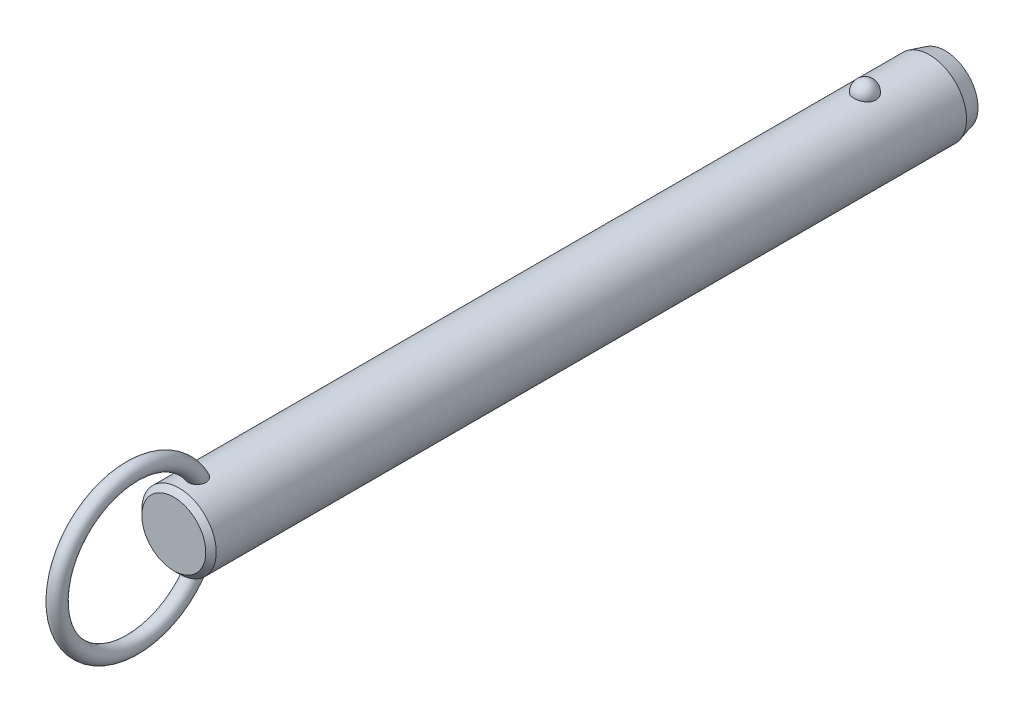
ISO-10303-21;
HEADER;
FILE_DESCRIPTION(('STEP AP214'),'2;1');
FILE_NAME('part.step','',(''),(''),'','','');
FILE_SCHEMA(('AUTOMOTIVE_DESIGN { 1 0 10303 214 1 1 1 1 }'));
ENDSEC;
DATA;
#1=APPLICATION_CONTEXT('core data for automotive mechanical design processes');
#2=APPLICATION_PROTOCOL_DEFINITION('international standard','automotive_design',2000,#1);
#3=PRODUCT_CONTEXT('',#1,'mechanical');
#4=PRODUCT('Part','Part','',(#3));
#5=PRODUCT_RELATED_PRODUCT_CATEGORY('part','',(#4));
#6=PRODUCT_DEFINITION_FORMATION('','',#4);
#7=PRODUCT_DEFINITION_CONTEXT('part definition',#1,'design');
#8=PRODUCT_DEFINITION('design','',#6,#7);
#9=PRODUCT_DEFINITION_SHAPE('','',#8);
#10=(LENGTH_UNIT() NAMED_UNIT(*) SI_UNIT(.MILLI.,.METRE.));
#11=(NAMED_UNIT(*) PLANE_ANGLE_UNIT() SI_UNIT($,.RADIAN.));
#12=(NAMED_UNIT(*) SI_UNIT($,.STERADIAN.) SOLID_ANGLE_UNIT());
#13=UNCERTAINTY_MEASURE_WITH_UNIT(LENGTH_MEASURE(1.E-05),#10,'distance_accuracy_value','');
#14=(GEOMETRIC_REPRESENTATION_CONTEXT(3) GLOBAL_UNCERTAINTY_ASSIGNED_CONTEXT((#13)) GLOBAL_UNIT_ASSIGNED_CONTEXT((#10,
#11,#12)) REPRESENTATION_CONTEXT('',''));
#15=CARTESIAN_POINT('',(0.,0.,0.));
#16=DIRECTION('',(0.,0.,1.));
#17=DIRECTION('',(1.,0.,0.));
#18=AXIS2_PLACEMENT_3D('',#15,#16,#17);
#19=CARTESIAN_POINT('',(0.,0.,121.9));
#20=DIRECTION('',(0.,0.,-1.));
#21=DIRECTION('',(-1.,0.,0.));
#22=AXIS2_PLACEMENT_3D('',#19,#20,#21);
#23=CYLINDRICAL_SURFACE('',#22,7.1);
#24=CARTESIAN_POINT('',(2.0769088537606,6.78943661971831,-2.1));
#25=CARTESIAN_POINT('',(2.07690739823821,6.78943796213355,-1.98268154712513));
#26=CARTESIAN_POINT('',(2.06738130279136,6.79237331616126,-1.86534506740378));
#27=CARTESIAN_POINT('',(2.0295040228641,6.8037853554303,-1.63400788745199));
#28=CARTESIAN_POINT('',(2.00114757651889,6.81226358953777,-1.52000812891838));
#29=CARTESIAN_POINT('',(1.92632025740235,6.83379798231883,-1.29863433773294));
#30=CARTESIAN_POINT('',(1.87985726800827,6.84685214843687,-1.19125744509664));
#31=CARTESIAN_POINT('',(1.76995205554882,6.87608091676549,-0.98604657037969));
#32=CARTESIAN_POINT('',(1.70650980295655,6.8922555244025,-0.88821260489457));
#33=CARTESIAN_POINT('',(1.5638119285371,6.92602930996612,-0.704242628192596));
#34=CARTESIAN_POINT('',(1.4844714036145,6.94363582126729,-0.618173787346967));
#35=CARTESIAN_POINT('',(1.31221746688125,6.97823658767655,-0.460740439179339));
#36=CARTESIAN_POINT('',(1.21930409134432,6.99523084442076,-0.389375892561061));
#37=CARTESIAN_POINT('',(1.02268781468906,7.02666176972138,-0.263547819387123));
#38=CARTESIAN_POINT('',(0.91902009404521,7.04110638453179,-0.209031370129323));
#39=CARTESIAN_POINT('',(0.703548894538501,7.06588726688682,-0.118163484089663));
#40=CARTESIAN_POINT('',(0.591746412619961,7.07622403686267,-0.0818098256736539));
#41=CARTESIAN_POINT('',(0.365557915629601,7.09147068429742,-0.0288711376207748));
#42=CARTESIAN_POINT('',(0.251267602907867,7.09648447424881,-0.0119070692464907));
#43=CARTESIAN_POINT('',(0.0213499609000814,7.10089837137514,0.00304925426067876));
#44=CARTESIAN_POINT('',(-0.0942772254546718,7.10029907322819,0.00104351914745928));
#45=CARTESIAN_POINT('',(-0.321651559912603,7.09360829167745,-0.0216931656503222));
#46=CARTESIAN_POINT('',(-0.433431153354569,7.08760388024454,-0.0421272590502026));
#47=CARTESIAN_POINT('',(-0.651862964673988,7.07086131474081,-0.100729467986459));
#48=CARTESIAN_POINT('',(-0.758515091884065,7.06012307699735,-0.138897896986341));
#49=CARTESIAN_POINT('',(-0.964449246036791,7.03496097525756,-0.232213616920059));
#50=CARTESIAN_POINT('',(-1.06368095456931,7.02051445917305,-0.287465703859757));
#51=CARTESIAN_POINT('',(-1.25145353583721,6.98948740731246,-0.413383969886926));
#52=CARTESIAN_POINT('',(-1.33999321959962,6.97290663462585,-0.48405186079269));
#53=CARTESIAN_POINT('',(-1.50591604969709,6.93898770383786,-0.640594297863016));
#54=CARTESIAN_POINT('',(-1.58302488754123,6.92164094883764,-0.726757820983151));
#55=CARTESIAN_POINT('',(-1.72189320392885,6.8884103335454,-0.91092752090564));
#56=CARTESIAN_POINT('',(-1.78365144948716,6.87252659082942,-1.008934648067));
#57=CARTESIAN_POINT('',(-1.89101272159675,6.84377189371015,-1.21549497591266));
#58=CARTESIAN_POINT('',(-1.93639553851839,6.83094274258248,-1.32416860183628));
#59=CARTESIAN_POINT('',(-2.00874275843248,6.81002070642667,-1.54791500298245));
#60=CARTESIAN_POINT('',(-2.03570774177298,6.80192767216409,-1.66298757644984));
#61=CARTESIAN_POINT('',(-2.07047276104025,6.7914266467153,-1.89571453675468));
#62=CARTESIAN_POINT('',(-2.07835878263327,6.78899315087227,-2.01335491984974));
#63=CARTESIAN_POINT('',(-2.07502083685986,6.79001409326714,-2.24833570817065));
#64=CARTESIAN_POINT('',(-2.06379746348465,6.7934683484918,-2.36567612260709));
#65=CARTESIAN_POINT('',(-2.02263913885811,6.80583442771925,-2.59603194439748));
#66=CARTESIAN_POINT('',(-1.99281127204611,6.81471501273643,-2.70906820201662));
#67=CARTESIAN_POINT('',(-1.91526639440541,6.83691232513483,-2.92836575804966));
#68=CARTESIAN_POINT('',(-1.8675486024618,6.85022924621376,-3.03462676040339));
#69=CARTESIAN_POINT('',(-1.75504492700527,6.87991336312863,-3.23806487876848));
#70=CARTESIAN_POINT('',(-1.69015924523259,6.89629822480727,-3.33518422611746));
#71=CARTESIAN_POINT('',(-1.54505404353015,6.93024852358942,-3.51697105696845));
#72=CARTESIAN_POINT('',(-1.46483385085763,6.94781401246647,-3.60163799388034));
#73=CARTESIAN_POINT('',(-1.29071406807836,6.98225977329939,-3.75654119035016));
#74=CARTESIAN_POINT('',(-1.19675650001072,6.99913673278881,-3.82671308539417));
#75=CARTESIAN_POINT('',(-0.997940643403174,7.03023618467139,-3.9501837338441));
#76=CARTESIAN_POINT('',(-0.89308318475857,7.04445887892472,-4.00348377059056));
#77=CARTESIAN_POINT('',(-0.676902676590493,7.06848365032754,-4.09107242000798));
#78=CARTESIAN_POINT('',(-0.565686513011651,7.0783430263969,-4.12560889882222));
#79=CARTESIAN_POINT('',(-0.338739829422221,7.09282534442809,-4.17575450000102));
#80=CARTESIAN_POINT('',(-0.223009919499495,7.09744899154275,-4.19136617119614));
#81=CARTESIAN_POINT('',(0.00707628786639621,7.10090930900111,-4.20307965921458));
#82=CARTESIAN_POINT('',(0.121410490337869,7.09986531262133,-4.19958377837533));
#83=CARTESIAN_POINT('',(0.347815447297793,7.092380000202,-4.17411564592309));
#84=CARTESIAN_POINT('',(0.459886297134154,7.08593891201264,-4.15214417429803));
#85=CARTESIAN_POINT('',(0.678084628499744,7.06838983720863,-4.09049562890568));
#86=CARTESIAN_POINT('',(0.784237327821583,7.05730369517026,-4.05090137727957));
#87=CARTESIAN_POINT('',(0.988305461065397,7.03163139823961,-3.95511447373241));
#88=CARTESIAN_POINT('',(1.08622031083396,7.01704499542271,-3.89892064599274));
#89=CARTESIAN_POINT('',(1.27284490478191,6.98562668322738,-3.77035541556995));
#90=CARTESIAN_POINT('',(1.36137372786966,6.96876135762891,-3.69772964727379));
#91=CARTESIAN_POINT('',(1.52509486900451,6.93477412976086,-3.53878279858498));
#92=CARTESIAN_POINT('',(1.60028496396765,6.91765218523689,-3.45245943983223));
#93=CARTESIAN_POINT('',(1.73681688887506,6.88465753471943,-3.26658774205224));
#94=CARTESIAN_POINT('',(1.79785966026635,6.86881574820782,-3.16681408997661));
#95=CARTESIAN_POINT('',(1.90265327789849,6.84053157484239,-2.95814408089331));
#96=CARTESIAN_POINT('',(1.94640861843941,6.82808830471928,-2.84925010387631));
#97=CARTESIAN_POINT('',(2.01274378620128,6.80881460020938,-2.63454318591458));
#98=CARTESIAN_POINT('',(2.03676193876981,6.80160856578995,-2.52920574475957));
#99=CARTESIAN_POINT('',(2.06884490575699,6.79191902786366,-2.3159172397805));
#100=CARTESIAN_POINT('',(2.07691019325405,6.78943538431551,-2.20796625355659));
#101=CARTESIAN_POINT('',(2.0769088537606,6.78943661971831,-2.1));
#102=B_SPLINE_CURVE_WITH_KNOTS('',3,(#24,#25,#26,#27,#28,#29,#30,#31,#32,#33,#34,#35,#36,#37,
#38,#39,#40,#41,#42,#43,#44,#45,#46,#47,#48,#49,#50,#51,#52,#53,#54,#55,#56,#57,#58,#59,#60,#61,
#62,#63,#64,#65,#66,#67,#68,#69,#70,#71,#72,#73,#74,#75,#76,#77,#78,#79,#80,#81,#82,#83,#84,#85,
#86,#87,#88,#89,#90,#91,#92,#93,#94,#95,#96,#97,#98,#99,#100,#101),.UNSPECIFIED.,.T.,.F.,(4,2,2,
2,2,2,2,2,2,2,2,2,2,2,2,2,2,2,2,2,2,2,2,2,2,2,2,2,2,2,2,2,2,2,2,2,2,2,4),(0.,0.351568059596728,
0.703234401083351,1.05474780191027,1.40626181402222,1.75970563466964,2.11314851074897,
2.4654696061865,2.81774759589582,3.16301449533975,3.50824481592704,3.84801136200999,
4.18778391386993,4.52968352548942,4.87162112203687,5.22076181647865,5.56993054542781,
5.92363364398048,6.27732559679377,6.62942052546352,6.98150450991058,7.33158042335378,
7.68167162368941,8.03384443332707,8.38603269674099,8.73975272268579,9.09344583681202,
9.44234545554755,9.79119807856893,10.1327344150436,10.4742563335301,10.8141898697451,
11.1541474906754,11.4997793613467,11.8454687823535,12.1979079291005,12.5502553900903,
12.8738073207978,13.1973496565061),.UNSPECIFIED.);
#103=CARTESIAN_POINT('',(2.0769088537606,6.78943661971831,-2.1));
#104=VERTEX_POINT('',#103);
#105=EDGE_CURVE('E41',#104,#104,#102,.T.);
#106=ORIENTED_EDGE('',*,*,#105,.T.);
#107=EDGE_LOOP('',(#106));
#108=FACE_BOUND('',#107,.T.);
#109=CARTESIAN_POINT('',(0.,0.,128.82));
#110=DIRECTION('',(0.,0.,1.));
#111=DIRECTION('',(1.,0.,0.));
#112=AXIS2_PLACEMENT_3D('',#109,#110,#111);
#113=CIRCLE('',#112,7.1);
#114=CARTESIAN_POINT('',(7.1,0.,128.82));
#115=VERTEX_POINT('',#114);
#116=EDGE_CURVE('E10',#115,#115,#113,.F.);
#117=ORIENTED_EDGE('',*,*,#116,.T.);
#118=EDGE_LOOP('',(#117));
#119=FACE_BOUND('',#118,.T.);
#120=CARTESIAN_POINT('',(-0.429539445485,-7.08699541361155,123.642921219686));
#121=CARTESIAN_POINT('',(-0.508331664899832,-7.08221999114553,123.666876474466));
#122=CARTESIAN_POINT('',(-0.58503984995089,-7.07624016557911,123.697457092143));
#123=CARTESIAN_POINT('',(-0.732082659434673,-7.06254296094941,123.771024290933));
#124=CARTESIAN_POINT('',(-0.802417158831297,-7.05482554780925,123.814011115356));
#125=CARTESIAN_POINT('',(-0.934722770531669,-7.03851844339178,123.911113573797));
#126=CARTESIAN_POINT('',(-0.99670020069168,-7.02992941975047,123.965220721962));
#127=CARTESIAN_POINT('',(-1.11079942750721,-7.01280697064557,124.082967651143));
#128=CARTESIAN_POINT('',(-1.16292136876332,-7.00427354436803,124.146607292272));
#129=CARTESIAN_POINT('',(-1.25705660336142,-6.98799959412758,124.282687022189));
#130=CARTESIAN_POINT('',(-1.29888032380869,-6.98027525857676,124.355259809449));
#131=CARTESIAN_POINT('',(-1.37069920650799,-6.96652886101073,124.506168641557));
#132=CARTESIAN_POINT('',(-1.40069157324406,-6.96050720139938,124.584506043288));
#133=CARTESIAN_POINT('',(-1.45043507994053,-6.95031881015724,124.750190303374));
#134=CARTESIAN_POINT('',(-1.46937115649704,-6.94630231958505,124.837789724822));
#135=CARTESIAN_POINT('',(-1.49424917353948,-6.94099239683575,125.014871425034));
#136=CARTESIAN_POINT('',(-1.50018601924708,-6.93970003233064,125.104354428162));
#137=CARTESIAN_POINT('',(-1.49978214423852,-6.93978815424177,125.294060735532));
#138=CARTESIAN_POINT('',(-1.49187639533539,-6.94150934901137,125.394279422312));
#139=CARTESIAN_POINT('',(-1.46177925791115,-6.94790814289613,125.592479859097));
#140=CARTESIAN_POINT('',(-1.43957541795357,-6.95258831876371,125.690459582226));
#141=CARTESIAN_POINT('',(-1.37783293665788,-6.96510647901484,125.89536292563));
#142=CARTESIAN_POINT('',(-1.33634073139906,-6.97328848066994,126.001680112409));
#143=CARTESIAN_POINT('',(-1.23686994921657,-6.99161706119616,126.206177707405));
#144=CARTESIAN_POINT('',(-1.17889192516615,-7.00176357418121,126.304358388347));
#145=CARTESIAN_POINT('',(-1.05875124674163,-7.02082898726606,126.472374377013));
#146=CARTESIAN_POINT('',(-0.999247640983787,-7.02963746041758,126.544123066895));
#147=CARTESIAN_POINT('',(-0.869494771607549,-7.04686074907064,126.677195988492));
#148=CARTESIAN_POINT('',(-0.799263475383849,-7.05527619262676,126.738537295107));
#149=CARTESIAN_POINT('',(-0.665408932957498,-7.06899457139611,126.835131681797));
#150=CARTESIAN_POINT('',(-0.603817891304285,-7.07457275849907,126.873151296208));
#151=CARTESIAN_POINT('',(-0.475172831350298,-7.08437420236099,126.938758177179));
#152=CARTESIAN_POINT('',(-0.408123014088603,-7.08859848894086,126.966353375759));
#153=CARTESIAN_POINT('',(-0.269431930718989,-7.09522749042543,127.009256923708));
#154=CARTESIAN_POINT('',(-0.197757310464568,-7.09761688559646,127.024461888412));
#155=CARTESIAN_POINT('',(-0.0527849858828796,-7.10017268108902,127.040716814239));
#156=CARTESIAN_POINT('',(0.0205115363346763,-7.10034065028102,127.041776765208));
#157=CARTESIAN_POINT('',(0.156426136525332,-7.09855986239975,127.030461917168));
#158=CARTESIAN_POINT('',(0.219199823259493,-7.09688191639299,127.019806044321));
#159=CARTESIAN_POINT('',(0.342134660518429,-7.09201880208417,126.988537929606));
#160=CARTESIAN_POINT('',(0.402295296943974,-7.08883333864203,126.967923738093));
#161=CARTESIAN_POINT('',(0.520687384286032,-7.08113868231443,126.917212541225));
#162=CARTESIAN_POINT('',(0.578791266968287,-7.07658958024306,126.886827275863));
#163=CARTESIAN_POINT('',(0.69017323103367,-7.06659708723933,126.818367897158));
#164=CARTESIAN_POINT('',(0.743447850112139,-7.061153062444,126.780288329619));
#165=CARTESIAN_POINT('',(0.87094790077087,-7.04680292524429,126.676592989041));
#166=CARTESIAN_POINT('',(0.941828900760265,-7.03755800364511,126.606897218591));
#167=CARTESIAN_POINT('',(1.07136606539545,-7.01900793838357,126.456945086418));
#168=CARTESIAN_POINT('',(1.13000013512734,-7.00970271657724,126.376670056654));
#169=CARTESIAN_POINT('',(1.23579584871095,-6.99183327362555,126.206899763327));
#170=CARTESIAN_POINT('',(1.28274271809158,-6.98328455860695,126.117269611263));
#171=CARTESIAN_POINT('',(1.3635144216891,-6.96796352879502,125.932176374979));
#172=CARTESIAN_POINT('',(1.39733971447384,-6.96119115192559,125.836713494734));
#173=CARTESIAN_POINT('',(1.45579181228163,-6.94922464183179,125.62530928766));
#174=CARTESIAN_POINT('',(1.47790145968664,-6.94449000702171,125.508631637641));
#175=CARTESIAN_POINT('',(1.50168752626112,-6.93938731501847,125.273015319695));
#176=CARTESIAN_POINT('',(1.50336085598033,-6.93901991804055,125.15407631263));
#177=CARTESIAN_POINT('',(1.48486516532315,-6.9430010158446,124.92360799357));
#178=CARTESIAN_POINT('',(1.46573441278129,-6.9471253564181,124.811995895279));
#179=CARTESIAN_POINT('',(1.40606892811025,-6.95944667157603,124.594886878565));
#180=CARTESIAN_POINT('',(1.36556446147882,-6.96763788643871,124.4893815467));
#181=CARTESIAN_POINT('',(1.27082700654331,-6.98548038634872,124.304287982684));
#182=CARTESIAN_POINT('',(1.21949810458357,-6.99473841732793,124.223171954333));
#183=CARTESIAN_POINT('',(1.10242050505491,-7.0141406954,124.072227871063));
#184=CARTESIAN_POINT('',(1.03668119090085,-7.02428436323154,124.00239252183));
#185=CARTESIAN_POINT('',(0.900559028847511,-7.04295285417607,123.883573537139));
#186=CARTESIAN_POINT('',(0.831428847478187,-7.05153466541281,123.833157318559));
#187=CARTESIAN_POINT('',(0.68529187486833,-7.06723150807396,123.745142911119));
#188=CARTESIAN_POINT('',(0.608287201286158,-7.07434693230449,123.707541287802));
#189=CARTESIAN_POINT('',(0.451878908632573,-7.08602232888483,123.647491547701));
#190=CARTESIAN_POINT('',(0.37268652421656,-7.09067127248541,123.624508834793));
#191=CARTESIAN_POINT('',(0.211477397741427,-7.09730788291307,123.592035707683));
#192=CARTESIAN_POINT('',(0.129460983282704,-7.09929585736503,123.58254373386));
#193=CARTESIAN_POINT('',(-0.0332905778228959,-7.10037858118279,123.577351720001));
#194=CARTESIAN_POINT('',(-0.114016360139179,-7.09953334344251,123.581365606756));
#195=CARTESIAN_POINT('',(-0.273670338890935,-7.09517338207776,123.602454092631));
#196=CARTESIAN_POINT('',(-0.352598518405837,-7.09165863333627,123.619528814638));
#197=CARTESIAN_POINT('',(-0.429539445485,-7.08699541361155,123.642921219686));
#198=B_SPLINE_CURVE_WITH_KNOTS('',3,(#120,#121,#122,#123,#124,#125,#126,#127,#128,#129,#130,
#131,#132,#133,#134,#135,#136,#137,#138,#139,#140,#141,#142,#143,#144,#145,#146,#147,#148,#149,
#150,#151,#152,#153,#154,#155,#156,#157,#158,#159,#160,#161,#162,#163,#164,#165,#166,#167,#168,
#169,#170,#171,#172,#173,#174,#175,#176,#177,#178,#179,#180,#181,#182,#183,#184,#185,#186,#187,
#188,#189,#190,#191,#192,#193,#194,#195,#196,#197),.UNSPECIFIED.,.T.,.F.,(4,2,2,2,2,2,2,2,2,2,2,
2,2,2,2,2,2,2,2,2,2,2,2,2,2,2,2,2,2,2,2,2,2,2,2,2,2,2,4),(0.,0.247183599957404,
0.494372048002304,0.741372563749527,0.988369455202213,1.23962059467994,1.49093106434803,
1.75897818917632,2.02713035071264,2.3275826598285,2.62829697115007,2.97008736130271,
3.31186629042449,3.59175319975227,3.8711763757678,4.08813841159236,4.30493502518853,
4.5235225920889,4.74195577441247,4.93215328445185,5.12238804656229,5.318848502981,
5.51544871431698,5.81332317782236,6.11173048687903,6.41527266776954,6.71880423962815,
7.07358156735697,7.42841252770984,7.76631485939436,8.10373999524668,8.39142246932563,
8.67891817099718,8.93560332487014,9.19221962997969,9.43881106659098,9.68537399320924,
9.92674752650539,10.1681233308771),.UNSPECIFIED.);
#199=CARTESIAN_POINT('',(-0.429539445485,-7.08699541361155,123.642921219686));
#200=VERTEX_POINT('',#199);
#201=EDGE_CURVE('E58',#200,#200,#198,.T.);
#202=ORIENTED_EDGE('',*,*,#201,.T.);
#203=EDGE_LOOP('',(#202));
#204=FACE_BOUND('',#203,.T.);
#205=CARTESIAN_POINT('',(-0.429539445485,7.08699541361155,123.642921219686));
#206=CARTESIAN_POINT('',(-0.351665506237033,7.09171429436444,123.619246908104));
#207=CARTESIAN_POINT('',(-0.271733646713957,7.09525896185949,123.602036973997));
#208=CARTESIAN_POINT('',(-0.110026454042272,7.09960839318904,123.581005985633));
#209=CARTESIAN_POINT('',(-0.0282502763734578,7.10041187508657,123.577191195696));
#210=CARTESIAN_POINT('',(0.134782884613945,7.09918849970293,123.583059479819));
#211=CARTESIAN_POINT('',(0.21603995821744,7.09716214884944,123.59274013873));
#212=CARTESIAN_POINT('',(0.375730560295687,7.09050177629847,123.625347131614));
#213=CARTESIAN_POINT('',(0.454164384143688,7.08586802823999,123.648272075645));
#214=CARTESIAN_POINT('',(0.60602533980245,7.07449911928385,123.706771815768));
#215=CARTESIAN_POINT('',(0.679451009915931,7.06776334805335,123.742350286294));
#216=CARTESIAN_POINT('',(0.819234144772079,7.05292866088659,123.825175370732));
#217=CARTESIAN_POINT('',(0.885591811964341,7.04482978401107,123.872421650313));
#218=CARTESIAN_POINT('',(1.00993211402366,7.02808709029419,123.977590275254));
#219=CARTESIAN_POINT('',(1.06785399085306,7.01943990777,124.035583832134));
#220=CARTESIAN_POINT('',(1.17342527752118,7.00256662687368,124.160301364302));
#221=CARTESIAN_POINT('',(1.22107408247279,6.99434055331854,124.227025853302));
#222=CARTESIAN_POINT('',(1.30652927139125,6.97889183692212,124.369362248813));
#223=CARTESIAN_POINT('',(1.34399711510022,6.97170674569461,124.445180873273));
#224=CARTESIAN_POINT('',(1.40682616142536,6.95930080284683,124.601810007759));
#225=CARTESIAN_POINT('',(1.43218374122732,6.95408053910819,124.68262200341));
#226=CARTESIAN_POINT('',(1.47246409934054,6.94566853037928,124.853531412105));
#227=CARTESIAN_POINT('',(1.48642590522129,6.9426653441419,124.94386307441));
#228=CARTESIAN_POINT('',(1.5011410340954,6.93949744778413,125.125619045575));
#229=CARTESIAN_POINT('',(1.50188917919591,6.93933385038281,125.217043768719));
#230=CARTESIAN_POINT('',(1.49030464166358,6.94183245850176,125.41084381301));
#231=CARTESIAN_POINT('',(1.47627413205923,6.94486147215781,125.513112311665));
#232=CARTESIAN_POINT('',(1.43356351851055,6.95380194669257,125.714471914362));
#233=CARTESIAN_POINT('',(1.4048676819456,6.95971650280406,125.813559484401));
#234=CARTESIAN_POINT('',(1.32908750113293,6.97461208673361,126.018908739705));
#235=CARTESIAN_POINT('',(1.28011435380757,6.98388945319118,126.124456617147));
#236=CARTESIAN_POINT('',(1.16520357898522,7.00397743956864,126.325760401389));
#237=CARTESIAN_POINT('',(1.09927694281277,7.01478706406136,126.421522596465));
#238=CARTESIAN_POINT('',(0.969361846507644,7.03373936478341,126.576756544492));
#239=CARTESIAN_POINT('',(0.909042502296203,7.04187023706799,126.639303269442));
#240=CARTESIAN_POINT('',(0.779178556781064,7.0574173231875,126.754053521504));
#241=CARTESIAN_POINT('',(0.70964977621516,7.06483472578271,126.806274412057));
#242=CARTESIAN_POINT('',(0.576854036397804,7.0767751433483,126.888113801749));
#243=CARTESIAN_POINT('',(0.515118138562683,7.08158033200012,126.920164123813));
#244=CARTESIAN_POINT('',(0.387127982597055,7.08972701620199,126.973765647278));
#245=CARTESIAN_POINT('',(0.320877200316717,7.09306962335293,126.995324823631));
#246=CARTESIAN_POINT('',(0.185041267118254,7.09791507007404,127.026400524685));
#247=CARTESIAN_POINT('',(0.115437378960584,7.09940591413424,127.035838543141));
#248=CARTESIAN_POINT('',(-0.0243157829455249,7.10030171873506,127.041522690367));
#249=CARTESIAN_POINT('',(-0.0944648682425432,7.0997073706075,127.037773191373));
#250=CARTESIAN_POINT('',(-0.225713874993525,7.09668414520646,127.018508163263));
#251=CARTESIAN_POINT('',(-0.287006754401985,7.09444865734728,127.004232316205));
#252=CARTESIAN_POINT('',(-0.406555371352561,7.08860360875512,126.966368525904));
#253=CARTESIAN_POINT('',(-0.464809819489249,7.08499346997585,126.942776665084));
#254=CARTESIAN_POINT('',(-0.594955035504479,7.07541654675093,126.878923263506));
#255=CARTESIAN_POINT('',(-0.66538935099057,7.06906574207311,126.835753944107));
#256=CARTESIAN_POINT('',(-0.798242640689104,7.05530261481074,126.738587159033));
#257=CARTESIAN_POINT('',(-0.860645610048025,7.0478882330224,126.684568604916));
#258=CARTESIAN_POINT('',(-0.994249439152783,7.03045217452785,126.550996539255));
#259=CARTESIAN_POINT('',(-1.06260129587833,7.02030745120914,126.468614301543));
#260=CARTESIAN_POINT('',(-1.18502045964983,7.00068382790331,126.293843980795));
#261=CARTESIAN_POINT('',(-1.23907684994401,6.99120544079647,126.201448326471));
#262=CARTESIAN_POINT('',(-1.33335589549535,6.97384343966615,126.008008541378));
#263=CARTESIAN_POINT('',(-1.37336138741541,6.96598557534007,125.906856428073));
#264=CARTESIAN_POINT('',(-1.43770677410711,6.9529905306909,125.699504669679));
#265=CARTESIAN_POINT('',(-1.46204473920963,6.94785368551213,125.59330440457));
#266=CARTESIAN_POINT('',(-1.49537533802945,6.94076296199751,125.368231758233));
#267=CARTESIAN_POINT('',(-1.50273564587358,6.93914842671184,125.24909751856));
#268=CARTESIAN_POINT('',(-1.4954555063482,6.94072368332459,125.011470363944));
#269=CARTESIAN_POINT('',(-1.48082914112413,6.94391040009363,124.892977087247));
#270=CARTESIAN_POINT('',(-1.43076401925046,6.95438579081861,124.673432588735));
#271=CARTESIAN_POINT('',(-1.39762227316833,6.96121852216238,124.571841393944));
#272=CARTESIAN_POINT('',(-1.31211274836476,6.97783941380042,124.377351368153));
#273=CARTESIAN_POINT('',(-1.2597660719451,6.98762432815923,124.28444313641));
#274=CARTESIAN_POINT('',(-1.14583073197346,7.00713153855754,124.124160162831));
#275=CARTESIAN_POINT('',(-1.0866594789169,7.01665982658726,124.055035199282));
#276=CARTESIAN_POINT('',(-0.956606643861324,7.03556646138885,123.928878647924));
#277=CARTESIAN_POINT('',(-0.885737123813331,7.04494495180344,123.871834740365));
#278=CARTESIAN_POINT('',(-0.751558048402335,7.06035735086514,123.783100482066));
#279=CARTESIAN_POINT('',(-0.690120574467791,7.0666695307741,123.748593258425));
#280=CARTESIAN_POINT('',(-0.562815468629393,7.07794609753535,123.688750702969));
#281=CARTESIAN_POINT('',(-0.496948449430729,7.08291067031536,123.663414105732));
#282=CARTESIAN_POINT('',(-0.429539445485,7.08699541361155,123.642921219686));
#283=B_SPLINE_CURVE_WITH_KNOTS('',3,(#205,#206,#207,#208,#209,#210,#211,#212,#213,#214,#215,
#216,#217,#218,#219,#220,#221,#222,#223,#224,#225,#226,#227,#228,#229,#230,#231,#232,#233,#234,
#235,#236,#237,#238,#239,#240,#241,#242,#243,#244,#245,#246,#247,#248,#249,#250,#251,#252,#253,
#254,#255,#256,#257,#258,#259,#260,#261,#262,#263,#264,#265,#266,#267,#268,#269,#270,#271,#272,
#273,#274,#275,#276,#277,#278,#279,#280,#281,#282),.UNSPECIFIED.,.T.,.F.,(4,2,2,2,2,2,2,2,2,2,2,
2,2,2,2,2,2,2,2,2,2,2,2,2,2,2,2,2,2,2,2,2,2,2,2,2,2,2,4),(0.,0.244335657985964,
0.488785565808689,0.733191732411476,0.977572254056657,1.22202379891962,1.46646834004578,
1.71259457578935,1.95873529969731,2.21226768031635,2.46587585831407,2.7391381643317,
3.01250754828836,3.32109936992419,3.63002293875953,3.97863512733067,4.32702187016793,
4.58793945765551,4.84841449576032,5.05676704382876,5.26496096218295,5.47449661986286,
5.68396281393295,5.8720544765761,6.06022532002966,6.30743751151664,6.55513496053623,
6.87602468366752,7.19715875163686,7.52305774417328,7.84899686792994,8.20516155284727,
8.56109821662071,8.88040084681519,9.19935367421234,9.47236282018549,9.7450922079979,
9.95662250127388,10.1681235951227),.UNSPECIFIED.);
#284=CARTESIAN_POINT('',(-0.429539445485,7.08699541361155,123.642921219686));
#285=VERTEX_POINT('',#284);
#286=EDGE_CURVE('E66',#285,#285,#283,.T.);
#287=ORIENTED_EDGE('',*,*,#286,.T.);
#288=EDGE_LOOP('',(#287));
#289=FACE_BOUND('',#288,.T.);
#290=CARTESIAN_POINT('',(0.,0.,-14.4));
#291=DIRECTION('',(0.,0.,-1.));
#292=DIRECTION('',(-1.,0.,0.));
#293=AXIS2_PLACEMENT_3D('',#290,#291,#292);
#294=CIRCLE('',#293,7.1);
#295=CARTESIAN_POINT('',(-7.1,0.,-14.4));
#296=VERTEX_POINT('',#295);
#297=EDGE_CURVE('E55',#296,#296,#294,.F.);
#298=ORIENTED_EDGE('',*,*,#297,.T.);
#299=EDGE_LOOP('',(#298));
#300=FACE_BOUND('',#299,.T.);
#301=ADVANCED_FACE('F37',(#108,#119,#204,#289,#300),#23,.T.);
#302=CARTESIAN_POINT('',(0.,0.,-17.4));
#303=DIRECTION('',(0.,0.,-1.));
#304=DIRECTION('',(-1.,0.,0.));
#305=AXIS2_PLACEMENT_3D('',#302,#303,#304);
#306=PLANE('',#305);
#307=CARTESIAN_POINT('',(0.,0.,-17.4));
#308=DIRECTION('',(0.,0.,-1.));
#309=DIRECTION('',(-1.,0.,0.));
#310=AXIS2_PLACEMENT_3D('',#307,#308,#309);
#311=CIRCLE('',#310,6.29615242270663);
#312=CARTESIAN_POINT('',(-6.29615242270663,0.,-17.4));
#313=VERTEX_POINT('',#312);
#314=EDGE_CURVE('E65',#313,#313,#311,.T.);
#315=ORIENTED_EDGE('',*,*,#314,.T.);
#316=EDGE_LOOP('',(#315));
#317=FACE_BOUND('',#316,.T.);
#318=ADVANCED_FACE('F84',(#317),#306,.T.);
#319=CARTESIAN_POINT('',(0.,0.,-17.4));
#320=DIRECTION('',(0.,0.,1.));
#321=DIRECTION('',(1.,0.,0.));
#322=AXIS2_PLACEMENT_3D('',#319,#320,#321);
#323=CONICAL_SURFACE('',#322,6.29615242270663,0.261799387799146);
#324=ORIENTED_EDGE('',*,*,#297,.F.);
#325=EDGE_LOOP('',(#324));
#326=FACE_BOUND('',#325,.T.);
#327=ORIENTED_EDGE('',*,*,#314,.F.);
#328=EDGE_LOOP('',(#327));
#329=FACE_BOUND('',#328,.T.);
#330=ADVANCED_FACE('F82',(#326,#329),#323,.T.);
#331=CARTESIAN_POINT('',(0.,0.,129.82));
#332=DIRECTION('',(0.,0.,1.));
#333=DIRECTION('',(1.,0.,0.));
#334=AXIS2_PLACEMENT_3D('',#331,#332,#333);
#335=PLANE('',#334);
#336=CARTESIAN_POINT('',(0.,0.,129.82));
#337=DIRECTION('',(0.,0.,1.));
#338=DIRECTION('',(1.,0.,0.));
#339=AXIS2_PLACEMENT_3D('',#336,#337,#338);
#340=CIRCLE('',#339,6.10000000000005);
#341=CARTESIAN_POINT('',(6.10000000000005,0.,129.82));
#342=VERTEX_POINT('',#341);
#343=EDGE_CURVE('E50',#342,#342,#340,.T.);
#344=ORIENTED_EDGE('',*,*,#343,.T.);
#345=EDGE_LOOP('',(#344));
#346=FACE_BOUND('',#345,.T.);
#347=ADVANCED_FACE('F76',(#346),#335,.T.);
#348=CARTESIAN_POINT('',(0.,0.,137.75));
#349=DIRECTION('',(1.,0.,0.));
#350=DIRECTION('',(0.,0.,-1.));
#351=AXIS2_PLACEMENT_3D('',#348,#349,#350);
#352=TOROIDAL_SURFACE('',#351,14.35,1.5);
#353=ORIENTED_EDGE('',*,*,#286,.F.);
#354=EDGE_LOOP('',(#353));
#355=FACE_BOUND('',#354,.T.);
#356=ORIENTED_EDGE('',*,*,#201,.F.);
#357=EDGE_LOOP('',(#356));
#358=FACE_BOUND('',#357,.T.);
#359=ADVANCED_FACE('F72',(#355,#358),#352,.T.);
#360=CARTESIAN_POINT('',(0.,0.,129.82));
#361=DIRECTION('',(0.,0.,-1.));
#362=DIRECTION('',(-1.,0.,0.));
#363=AXIS2_PLACEMENT_3D('',#360,#361,#362);
#364=CONICAL_SURFACE('',#363,6.10000000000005,0.78539816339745);
#365=ORIENTED_EDGE('',*,*,#116,.F.);
#366=EDGE_LOOP('',(#365));
#367=FACE_BOUND('',#366,.T.);
#368=ORIENTED_EDGE('',*,*,#343,.F.);
#369=EDGE_LOOP('',(#368));
#370=FACE_BOUND('',#369,.T.);
#371=ADVANCED_FACE('F39',(#367,#370),#364,.T.);
#372=CARTESIAN_POINT('',(0.,7.1,-2.1));
#373=DIRECTION('',(0.,1.,0.));
#374=DIRECTION('',(0.,0.,1.));
#375=AXIS2_PLACEMENT_3D('',#372,#373,#374);
#376=SPHERICAL_SURFACE('',#375,2.10000000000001);
#377=ORIENTED_EDGE('',*,*,#105,.F.);
#378=EDGE_LOOP('',(#377));
#379=FACE_BOUND('',#378,.T.);
#380=ADVANCED_FACE('F78',(#379),#376,.T.);
#381=CLOSED_SHELL('',(#301,#318,#330,#347,#359,#371,#380));
#382=MANIFOLD_SOLID_BREP('B2',#381);
#383=ADVANCED_BREP_SHAPE_REPRESENTATION('',(#18,#382),#14);
#384=SHAPE_DEFINITION_REPRESENTATION(#9,#383);
ENDSEC;
END-ISO-10303-21;
